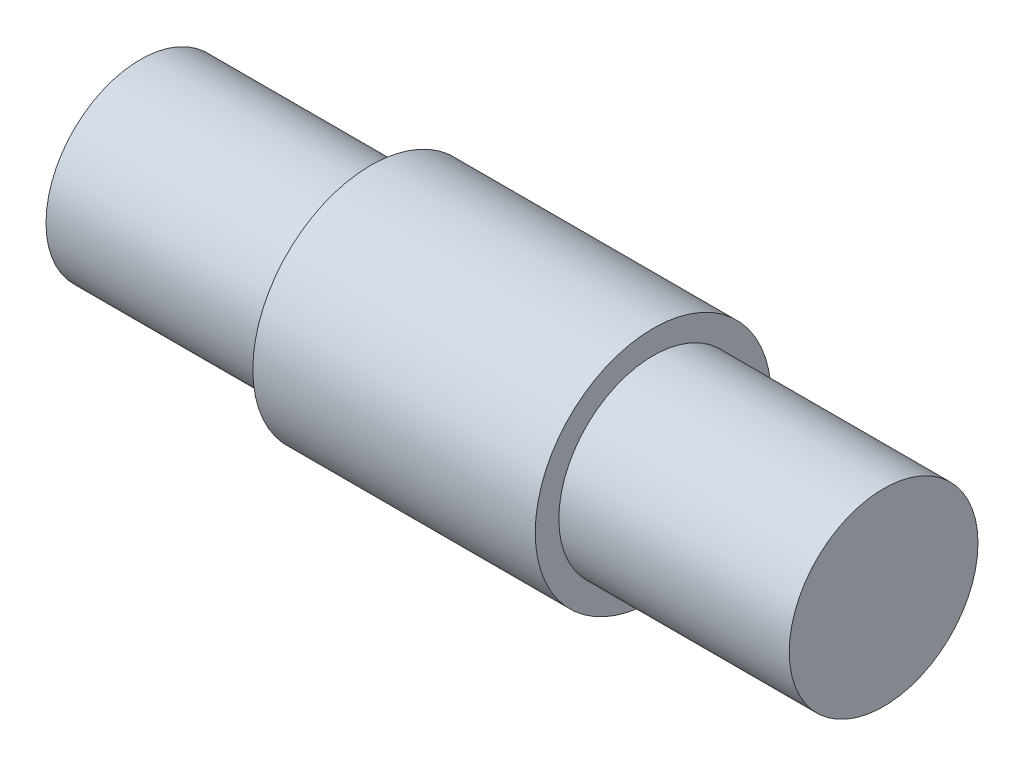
from build123d import *


with BuildPart() as part:
    # Sketch1 → Revolve1 (revolve)
    with BuildSketch(Plane.XY, mode=Mode.PRIVATE) as revolve1_sk:
        Polygon((-12.5, 0), (-12.5, 3.175), (-4.75, 3.175), (-4.75, 3.96875), (4.75, 3.96875), (4.75, 3.175), (12.5, 3.175), (12.5, 0), align=None)
    revolve(revolve1_sk.sketch.rotate(Axis((-76.456488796, 0, 0), (1, 0, 0)), 90), axis=Axis((-76.456488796, 0, 0), (1, 0, 0)))


solid = part.part
